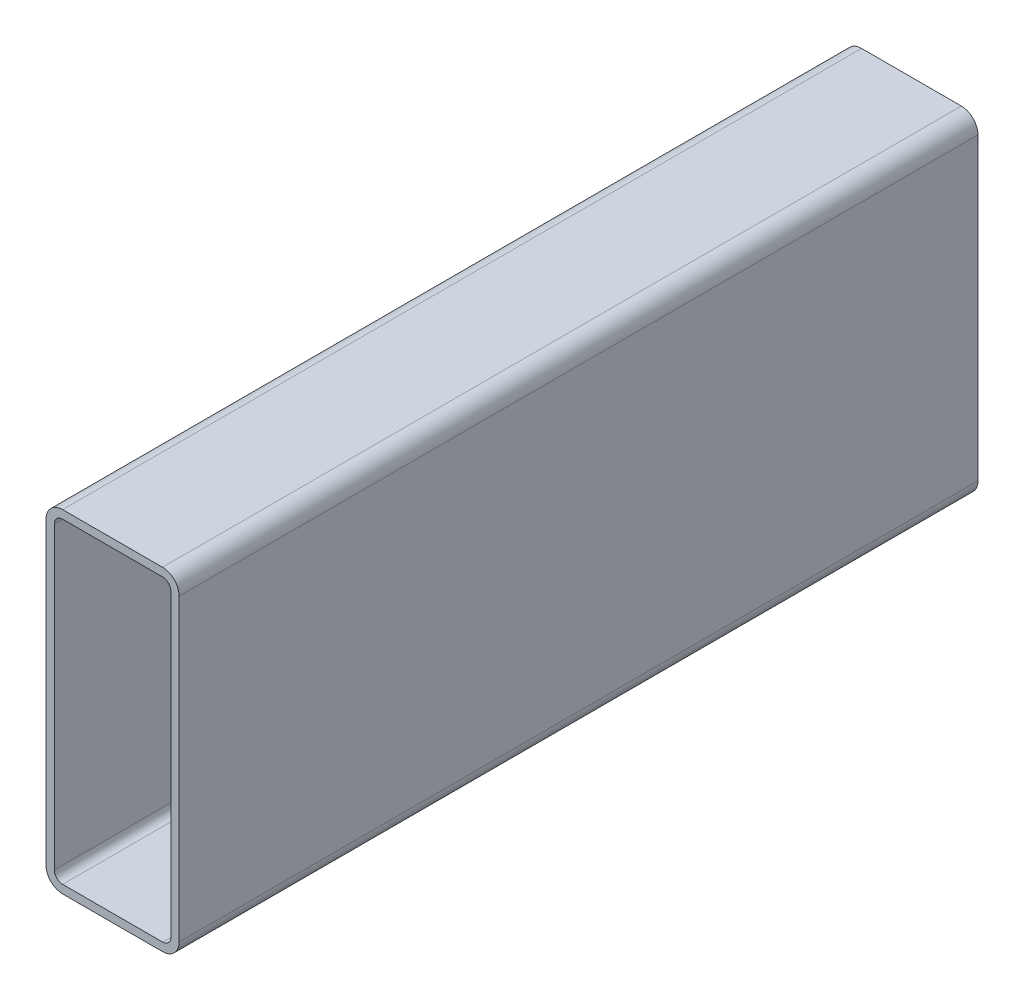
from build123d import *

# Parameters (mm, degrees)
BOSS_EXTRUDE1_DEPTH = 304.8


with BuildPart() as part:
    # Sketch1 → Boss-Extrude1 (new body)
    with BuildSketch(Plane.XY):
        with BuildLine():
            Line((6.35, 127), (44.45, 127))
            ThreePointArc((44.45, 127), (48.940128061, 125.140128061), (50.8, 120.65))
            Line((50.8, 120.65), (50.8, 6.35))
            ThreePointArc((50.8, 6.35), (48.940128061, 1.859871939), (44.45, 0))
            Line((44.45, 0), (6.35, 0))
            ThreePointArc((6.35, 0), (1.859871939, 1.859871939), (0, 6.35))
            Line((0, 6.35), (0, 120.65))
            ThreePointArc((0, 120.65), (1.859871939, 125.140128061), (6.35, 127))
        make_face()
        with BuildLine():
            Line((6.35, 123.825), (44.45, 123.825))
            ThreePointArc((44.45, 123.825), (46.69506403, 122.89506403), (47.625, 120.65))
            Line((47.625, 120.65), (47.625, 6.35))
            ThreePointArc((47.625, 6.35), (46.69506403, 4.10493597), (44.45, 3.175))
            Line((44.45, 3.175), (6.35, 3.175))
            ThreePointArc((6.35, 3.175), (4.10493597, 4.10493597), (3.175, 6.35))
            Line((3.175, 6.35), (3.175, 120.65))
            ThreePointArc((3.175, 120.65), (4.10493597, 122.89506403), (6.35, 123.825))
        make_face(mode=Mode.SUBTRACT)
    extrude(amount=BOSS_EXTRUDE1_DEPTH)


solid = part.part
